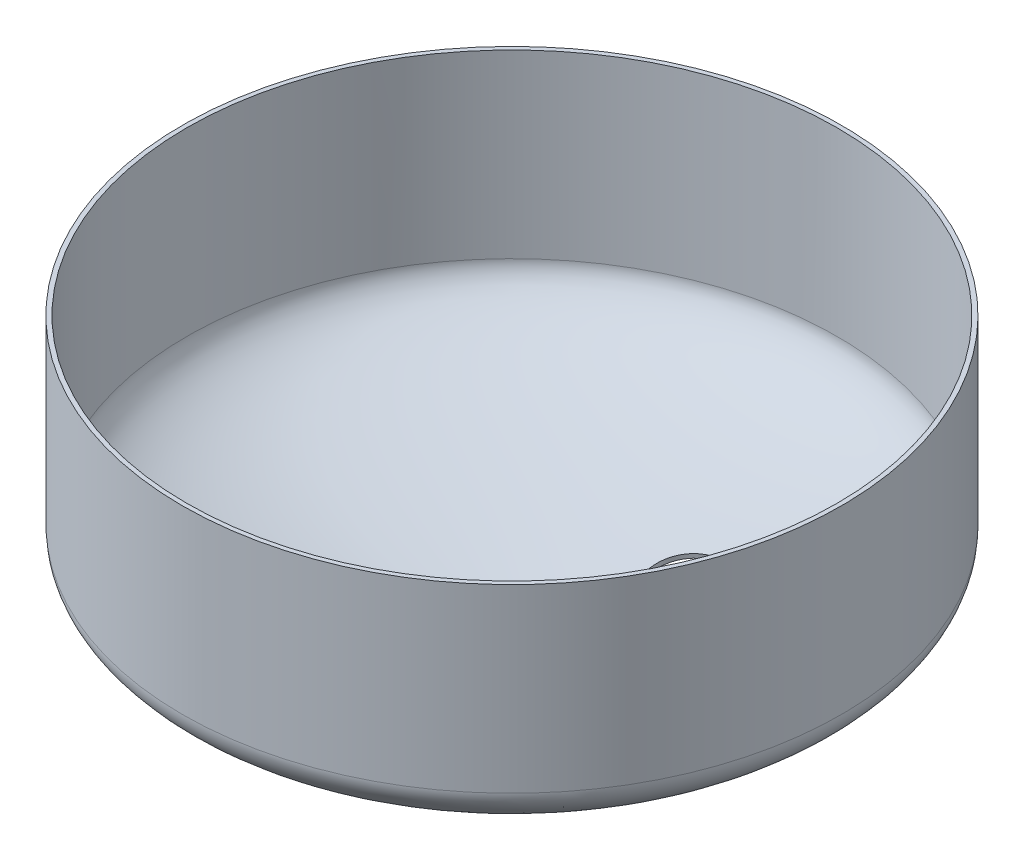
ISO-10303-21;
HEADER;
FILE_DESCRIPTION(('STEP AP214'),'2;1');
FILE_NAME('part.step','',(''),(''),'','','');
FILE_SCHEMA(('AUTOMOTIVE_DESIGN { 1 0 10303 214 1 1 1 1 }'));
ENDSEC;
DATA;
#1=APPLICATION_CONTEXT('core data for automotive mechanical design processes');
#2=APPLICATION_PROTOCOL_DEFINITION('international standard','automotive_design',2000,#1);
#3=PRODUCT_CONTEXT('',#1,'mechanical');
#4=PRODUCT('Part','Part','',(#3));
#5=PRODUCT_RELATED_PRODUCT_CATEGORY('part','',(#4));
#6=PRODUCT_DEFINITION_FORMATION('','',#4);
#7=PRODUCT_DEFINITION_CONTEXT('part definition',#1,'design');
#8=PRODUCT_DEFINITION('design','',#6,#7);
#9=PRODUCT_DEFINITION_SHAPE('','',#8);
#10=(LENGTH_UNIT() NAMED_UNIT(*) SI_UNIT(.MILLI.,.METRE.));
#11=(NAMED_UNIT(*) PLANE_ANGLE_UNIT() SI_UNIT($,.RADIAN.));
#12=(NAMED_UNIT(*) SI_UNIT($,.STERADIAN.) SOLID_ANGLE_UNIT());
#13=UNCERTAINTY_MEASURE_WITH_UNIT(LENGTH_MEASURE(1.E-05),#10,'distance_accuracy_value','');
#14=(GEOMETRIC_REPRESENTATION_CONTEXT(3) GLOBAL_UNCERTAINTY_ASSIGNED_CONTEXT((#13)) GLOBAL_UNIT_ASSIGNED_CONTEXT((#10,
#11,#12)) REPRESENTATION_CONTEXT('',''));
#15=CARTESIAN_POINT('',(0.,0.,0.));
#16=DIRECTION('',(0.,0.,1.));
#17=DIRECTION('',(1.,0.,0.));
#18=AXIS2_PLACEMENT_3D('',#15,#16,#17);
#19=CARTESIAN_POINT('',(0.,60.7998342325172,187.780368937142));
#20=DIRECTION('',(1.,0.,0.));
#21=DIRECTION('',(0.,0.,-1.));
#22=AXIS2_PLACEMENT_3D('',#19,#20,#21);
#23=ELLIPSE('',#22,377.780368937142,74.407850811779);
#24=TRIMMED_CURVE('',#23,(PARAMETER_VALUE(5.23259887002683)),
(PARAMETER_VALUE(7.33377174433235)),.T.,.PARAMETER.);
#25=CARTESIAN_POINT('',(0.,182.531914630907,0.));
#26=DIRECTION('',(0.,1.,0.));
#27=AXIS1_PLACEMENT('',#25,#26);
#28=SURFACE_OF_REVOLUTION('',#24,#27);
#29=CARTESIAN_POINT('',(0.,0.,0.));
#30=DIRECTION('',(0.,1.,0.));
#31=DIRECTION('',(0.,0.,1.));
#32=AXIS2_PLACEMENT_3D('',#29,#30,#31);
#33=CIRCLE('',#32,29.9999999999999);
#34=CARTESIAN_POINT('',(0.,0.,29.9999999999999));
#35=VERTEX_POINT('',#34);
#36=EDGE_CURVE('E10',#35,#35,#33,.T.);
#37=ORIENTED_EDGE('',*,*,#36,.T.);
#38=EDGE_LOOP('',(#37));
#39=FACE_BOUND('',#38,.T.);
#40=CARTESIAN_POINT('',(0.,60.7998342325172,0.));
#41=DIRECTION('',(0.,1.,0.));
#42=DIRECTION('',(0.,0.,1.));
#43=AXIS2_PLACEMENT_3D('',#40,#41,#42);
#44=CIRCLE('',#43,190.);
#45=CARTESIAN_POINT('',(0.,60.7998342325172,190.));
#46=VERTEX_POINT('',#45);
#47=EDGE_CURVE('E43',#46,#46,#44,.T.);
#48=ORIENTED_EDGE('',*,*,#47,.F.);
#49=EDGE_LOOP('',(#48));
#50=FACE_BOUND('',#49,.T.);
#51=CARTESIAN_POINT('',(29.9766896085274,11.3534303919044,-89.640225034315));
#52=CARTESIAN_POINT('',(30.5372190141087,11.3913939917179,-89.633517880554));
#53=CARTESIAN_POINT('',(31.0976608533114,11.4255208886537,-89.6034285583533));
#54=CARTESIAN_POINT('',(32.2147049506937,11.4859134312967,-89.4966945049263));
#55=CARTESIAN_POINT('',(32.7713061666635,11.5121770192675,-89.4200376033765));
#56=CARTESIAN_POINT('',(33.877129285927,11.5566895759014,-89.2205831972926));
#57=CARTESIAN_POINT('',(34.4263423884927,11.5749296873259,-89.0977349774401));
#58=CARTESIAN_POINT('',(35.5128279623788,11.6032401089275,-88.8067880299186));
#59=CARTESIAN_POINT('',(36.0501012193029,11.6133109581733,-88.6386922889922));
#60=CARTESIAN_POINT('',(37.1086787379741,11.6252194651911,-88.2585263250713));
#61=CARTESIAN_POINT('',(37.6299900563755,11.6270608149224,-88.0464758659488));
#62=CARTESIAN_POINT('',(38.6531971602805,11.6225090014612,-87.5798586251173));
#63=CARTESIAN_POINT('',(39.1550926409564,11.6161157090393,-87.325291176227));
#64=CARTESIAN_POINT('',(40.1357660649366,11.5951366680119,-86.7755235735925));
#65=CARTESIAN_POINT('',(40.6145498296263,11.5805529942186,-86.4803337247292));
#66=CARTESIAN_POINT('',(41.5457322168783,11.543285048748,-85.8513743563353));
#67=CARTESIAN_POINT('',(41.9981309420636,11.5206008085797,-85.5176049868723));
#68=CARTESIAN_POINT('',(42.8733717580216,11.4672694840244,-84.8138299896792));
#69=CARTESIAN_POINT('',(43.2962111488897,11.4366216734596,-84.4438210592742));
#70=CARTESIAN_POINT('',(44.1092853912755,11.3675531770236,-83.6702279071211));
#71=CARTESIAN_POINT('',(44.4995202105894,11.3291324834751,-83.2666436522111));
#72=CARTESIAN_POINT('',(45.2446291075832,11.2447528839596,-82.4287595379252));
#73=CARTESIAN_POINT('',(45.5995018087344,11.198793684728,-81.9944584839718));
#74=CARTESIAN_POINT('',(46.2713509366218,11.0996199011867,-81.0982501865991));
#75=CARTESIAN_POINT('',(46.5883273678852,11.0464053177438,-80.6363429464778));
#76=CARTESIAN_POINT('',(47.1821544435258,10.9330423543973,-79.6881854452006));
#77=CARTESIAN_POINT('',(47.4590025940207,10.8728935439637,-79.2019336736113));
#78=CARTESIAN_POINT('',(47.9705873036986,10.7460310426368,-78.2085807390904));
#79=CARTESIAN_POINT('',(48.2053238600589,10.6793173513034,-77.7014795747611));
#80=CARTESIAN_POINT('',(48.6310226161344,10.5397300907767,-76.6700449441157));
#81=CARTESIAN_POINT('',(48.821984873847,10.4668565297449,-76.1457115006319));
#82=CARTESIAN_POINT('',(49.1587845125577,10.3153905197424,-75.0835515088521));
#83=CARTESIAN_POINT('',(49.3046218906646,10.2367980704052,-74.5457249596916));
#84=CARTESIAN_POINT('',(49.55015460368,10.0743605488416,-73.4603588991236));
#85=CARTESIAN_POINT('',(49.6498451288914,9.9905149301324,-72.9128183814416));
#86=CARTESIAN_POINT('',(49.802359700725,9.81808457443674,-71.8119865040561));
#87=CARTESIAN_POINT('',(49.8551837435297,9.72949983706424,-71.2586951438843));
#88=CARTESIAN_POINT('',(49.9135964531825,9.54812645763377,-70.1503118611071));
#89=CARTESIAN_POINT('',(49.9191851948,9.45533782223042,-69.5952199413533));
#90=CARTESIAN_POINT('',(49.8830943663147,9.26611836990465,-68.4871976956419));
#91=CARTESIAN_POINT('',(49.8414147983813,9.16968755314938,-67.9342673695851));
#92=CARTESIAN_POINT('',(49.7110908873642,8.97377154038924,-66.8345228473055));
#93=CARTESIAN_POINT('',(49.622447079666,8.87428637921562,-66.287708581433));
#94=CARTESIAN_POINT('',(49.3988315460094,8.67287041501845,-65.2040948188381));
#95=CARTESIAN_POINT('',(49.2638598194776,8.57093961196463,-64.6672953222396));
#96=CARTESIAN_POINT('',(48.9485542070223,8.36526377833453,-63.6075448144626));
#97=CARTESIAN_POINT('',(48.7682203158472,8.26151874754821,-63.0845938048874));
#98=CARTESIAN_POINT('',(48.363478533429,8.05286627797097,-62.0562749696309));
#99=CARTESIAN_POINT('',(48.13907064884,7.94795883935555,-61.5509071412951));
#100=CARTESIAN_POINT('',(47.6478242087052,7.73767064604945,-60.5614473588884));
#101=CARTESIAN_POINT('',(47.3809929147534,7.63228997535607,-60.0773517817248));
#102=CARTESIAN_POINT('',(46.8067740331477,7.42172660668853,-59.1337978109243));
#103=CARTESIAN_POINT('',(46.4993864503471,7.31654390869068,-58.6743394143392));
#104=CARTESIAN_POINT('',(45.846244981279,7.10708321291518,-57.7833351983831));
#105=CARTESIAN_POINT('',(45.5004911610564,7.00280521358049,-57.3517893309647));
#106=CARTESIAN_POINT('',(44.7730777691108,6.79587670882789,-56.5196810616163));
#107=CARTESIAN_POINT('',(44.3914181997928,6.69322620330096,-56.1191186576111));
#108=CARTESIAN_POINT('',(43.5949639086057,6.49030509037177,-55.3518774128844));
#109=CARTESIAN_POINT('',(43.1801738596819,6.39003414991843,-54.9851938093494));
#110=CARTESIAN_POINT('',(42.3203585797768,6.19260830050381,-54.2882448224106));
#111=CARTESIAN_POINT('',(41.8753333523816,6.09545339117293,-53.9579794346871));
#112=CARTESIAN_POINT('',(40.9582055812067,5.90502122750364,-53.336199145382));
#113=CARTESIAN_POINT('',(40.4861030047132,5.81174397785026,-53.0446842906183));
#114=CARTESIAN_POINT('',(39.51816813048,5.62983583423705,-52.5024559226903));
#115=CARTESIAN_POINT('',(39.0223358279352,5.54120494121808,-52.251742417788));
#116=CARTESIAN_POINT('',(38.0103715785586,5.36934570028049,-51.7928337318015));
#117=CARTESIAN_POINT('',(37.4942363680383,5.28611822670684,-51.5846454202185));
#118=CARTESIAN_POINT('',(36.445394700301,5.12584599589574,-51.2122845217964));
#119=CARTESIAN_POINT('',(35.9126882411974,5.04880123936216,-51.0481119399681));
#120=CARTESIAN_POINT('',(34.8344702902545,4.90164324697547,-50.7649115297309));
#121=CARTESIAN_POINT('',(34.2889587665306,4.8315300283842,-50.6458838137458));
#122=CARTESIAN_POINT('',(33.1889881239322,4.69895652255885,-50.453779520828));
#123=CARTESIAN_POINT('',(32.6345290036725,4.6364962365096,-50.3807029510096));
#124=CARTESIAN_POINT('',(31.5204373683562,4.51989207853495,-50.2809665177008));
#125=CARTESIAN_POINT('',(30.9608035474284,4.46575037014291,-50.2543187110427));
#126=CARTESIAN_POINT('',(29.8404633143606,4.36642237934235,-50.2476267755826));
#127=CARTESIAN_POINT('',(29.2797569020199,4.32123609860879,-50.2675826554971));
#128=CARTESIAN_POINT('',(28.1612424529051,4.24036057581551,-50.35391976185));
#129=CARTESIAN_POINT('',(27.6034344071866,4.2046713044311,-50.4203008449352));
#130=CARTESIAN_POINT('',(26.4946680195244,4.14323444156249,-50.598985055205));
#131=CARTESIAN_POINT('',(25.9437096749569,4.1174868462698,-50.7112881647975));
#132=CARTESIAN_POINT('',(24.8527113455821,4.07627030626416,-50.9809541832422));
#133=CARTESIAN_POINT('',(24.3126682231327,4.06079836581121,-51.1383039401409));
#134=CARTESIAN_POINT('',(23.2471701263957,4.04032416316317,-51.4969420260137));
#135=CARTESIAN_POINT('',(22.7217151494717,4.03532189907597,-51.6982303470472));
#136=CARTESIAN_POINT('',(21.689131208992,4.0358533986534,-52.143307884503));
#137=CARTESIAN_POINT('',(21.1820022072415,4.04138714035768,-52.3870970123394));
#138=CARTESIAN_POINT('',(20.1896798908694,4.06291722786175,-52.9154472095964));
#139=CARTESIAN_POINT('',(19.7044865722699,4.07891357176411,-53.2000082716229));
#140=CARTESIAN_POINT('',(18.7596869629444,4.12115045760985,-53.807769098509));
#141=CARTESIAN_POINT('',(18.3000702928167,4.14738680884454,-54.1309530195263));
#142=CARTESIAN_POINT('',(17.4094855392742,4.20976761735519,-54.8137804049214));
#143=CARTESIAN_POINT('',(16.978517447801,4.24591207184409,-55.1734238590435));
#144=CARTESIAN_POINT('',(16.1483017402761,4.3276601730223,-55.926649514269));
#145=CARTESIAN_POINT('',(15.749054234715,4.37326385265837,-56.3202318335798));
#146=CARTESIAN_POINT('',(14.9851301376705,4.47338577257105,-57.1385777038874));
#147=CARTESIAN_POINT('',(14.6204535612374,4.52790401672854,-57.5633412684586));
#148=CARTESIAN_POINT('',(13.9281434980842,4.64525591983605,-58.4412429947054));
#149=CARTESIAN_POINT('',(13.6005241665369,4.70809273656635,-58.8943918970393));
#150=CARTESIAN_POINT('',(12.984831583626,4.84138486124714,-59.825742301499));
#151=CARTESIAN_POINT('',(12.6967583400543,4.9118401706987,-60.3039438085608));
#152=CARTESIAN_POINT('',(12.1622198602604,5.05964654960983,-61.2820436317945));
#153=CARTESIAN_POINT('',(11.9157546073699,5.13699761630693,-61.7819419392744));
#154=CARTESIAN_POINT('',(11.4661977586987,5.29784568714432,-62.7999220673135));
#155=CARTESIAN_POINT('',(11.2631061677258,5.38134269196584,-63.3180038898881));
#156=CARTESIAN_POINT('',(10.9016956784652,5.55374529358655,-64.3688706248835));
#157=CARTESIAN_POINT('',(10.7433910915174,5.64265260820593,-64.901660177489));
#158=CARTESIAN_POINT('',(10.4727787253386,5.8250806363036,-65.9780218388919));
#159=CARTESIAN_POINT('',(10.3604709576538,5.91860135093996,-66.5215939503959));
#160=CARTESIAN_POINT('',(10.1826608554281,6.10948689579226,-67.6156748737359));
#161=CARTESIAN_POINT('',(10.117158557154,6.20685172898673,-68.1661836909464));
#162=CARTESIAN_POINT('',(10.0334328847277,6.40466314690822,-69.2702345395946));
#163=CARTESIAN_POINT('',(10.0152094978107,6.5051097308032,-69.8237765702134));
#164=CARTESIAN_POINT('',(10.0261745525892,6.70830840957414,-70.9298274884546));
#165=CARTESIAN_POINT('',(10.0553514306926,6.81105993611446,-71.4823365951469));
#166=CARTESIAN_POINT('',(10.1608896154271,7.01815468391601,-72.5825289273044));
#167=CARTESIAN_POINT('',(10.2372509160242,7.12249790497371,-73.1302121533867));
#168=CARTESIAN_POINT('',(10.4366143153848,7.33205390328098,-74.216854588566));
#169=CARTESIAN_POINT('',(10.5596164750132,7.43726668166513,-74.7558137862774));
#170=CARTESIAN_POINT('',(10.8513838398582,7.64785586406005,-75.821166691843));
#171=CARTESIAN_POINT('',(11.0201490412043,7.75323226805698,-76.3475604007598));
#172=CARTESIAN_POINT('',(11.4022069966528,7.96344364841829,-77.3839455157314));
#173=CARTESIAN_POINT('',(11.6154926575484,8.06827870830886,-77.8939395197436));
#174=CARTESIAN_POINT('',(12.0850853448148,8.27675474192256,-78.8939746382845));
#175=CARTESIAN_POINT('',(12.3413923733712,8.38039571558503,-79.3840157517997));
#176=CARTESIAN_POINT('',(12.8951881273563,8.58582938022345,-80.3406289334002));
#177=CARTESIAN_POINT('',(13.1926752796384,8.68762214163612,-80.8072018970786));
#178=CARTESIAN_POINT('',(13.8267165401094,8.88873358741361,-81.7135671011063));
#179=CARTESIAN_POINT('',(14.1632706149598,8.98805227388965,-82.153359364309));
#180=CARTESIAN_POINT('',(14.873054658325,9.18360980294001,-83.0030321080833));
#181=CARTESIAN_POINT('',(15.2462854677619,9.27984857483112,-83.4129119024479));
#182=CARTESIAN_POINT('',(16.0267582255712,9.46865927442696,-84.1998213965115));
#183=CARTESIAN_POINT('',(16.4340003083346,9.56123118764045,-84.5768509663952));
#184=CARTESIAN_POINT('',(17.2797012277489,9.74217071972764,-85.295454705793));
#185=CARTESIAN_POINT('',(17.7181679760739,9.83053726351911,-85.6370198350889));
#186=CARTESIAN_POINT('',(18.6230953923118,10.0025058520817,-86.2821362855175));
#187=CARTESIAN_POINT('',(19.0895556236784,10.0861079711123,-86.5856881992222));
#188=CARTESIAN_POINT('',(20.0474556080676,10.2480954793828,-87.1527894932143));
#189=CARTESIAN_POINT('',(20.5389108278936,10.3264775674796,-87.4163136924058));
#190=CARTESIAN_POINT('',(21.5430583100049,10.4774982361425,-87.9012571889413));
#191=CARTESIAN_POINT('',(22.0557519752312,10.5501364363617,-88.1226736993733));
#192=CARTESIAN_POINT('',(23.0981291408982,10.6891476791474,-88.5215718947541));
#193=CARTESIAN_POINT('',(23.627793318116,10.7555275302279,-88.6991016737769));
#194=CARTESIAN_POINT('',(24.7006950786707,10.8816892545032,-89.0092243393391));
#195=CARTESIAN_POINT('',(25.2439290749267,10.9414728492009,-89.1418289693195));
#196=CARTESIAN_POINT('',(26.4791717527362,11.0683675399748,-89.3889930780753));
#197=CARTESIAN_POINT('',(27.1740363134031,11.1335035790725,-89.4904909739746));
#198=CARTESIAN_POINT('',(28.5715429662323,11.2522453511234,-89.620309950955));
#199=CARTESIAN_POINT('',(29.2741850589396,11.3058510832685,-89.6486310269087));
#200=CARTESIAN_POINT('',(29.9766896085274,11.3534303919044,-89.640225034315));
#201=B_SPLINE_CURVE_WITH_KNOTS('',3,(#51,#52,#53,#54,#55,#56,#57,#58,#59,#60,#61,#62,#63,#64,
#65,#66,#67,#68,#69,#70,#71,#72,#73,#74,#75,#76,#77,#78,#79,#80,#81,#82,#83,#84,#85,#86,#87,#88,
#89,#90,#91,#92,#93,#94,#95,#96,#97,#98,#99,#100,#101,#102,#103,#104,#105,#106,#107,#108,#109,
#110,#111,#112,#113,#114,#115,#116,#117,#118,#119,#120,#121,#122,#123,#124,#125,#126,#127,#128,
#129,#130,#131,#132,#133,#134,#135,#136,#137,#138,#139,#140,#141,#142,#143,#144,#145,#146,#147,
#148,#149,#150,#151,#152,#153,#154,#155,#156,#157,#158,#159,#160,#161,#162,#163,#164,#165,#166,
#167,#168,#169,#170,#171,#172,#173,#174,#175,#176,#177,#178,#179,#180,#181,#182,#183,#184,#185,
#186,#187,#188,#189,#190,#191,#192,#193,#194,#195,#196,#197,#198,#199,#200),.UNSPECIFIED.,.T.,
.F.,(4,2,2,2,2,2,2,2,2,2,2,2,2,2,2,2,2,2,2,2,2,2,2,2,2,2,2,2,2,2,2,2,2,2,2,2,2,2,2,2,2,2,2,2,2,
2,2,2,2,2,2,2,2,2,2,2,2,2,2,2,2,2,2,2,2,2,2,2,2,2,2,2,2,2,4),(0.,1.68494583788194,
3.37033222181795,5.05757448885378,6.74470541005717,8.43107936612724,10.1174797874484,
11.8034531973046,13.4894200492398,15.1755406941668,16.8616630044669,18.5478509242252,
20.2340386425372,21.9203311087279,23.6066236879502,25.2929140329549,26.9792044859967,
28.6656706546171,30.3521369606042,32.0386005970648,33.7250641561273,35.4115084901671,
37.097952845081,38.7843973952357,40.4708416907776,42.1569976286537,43.8431533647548,
45.5293061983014,47.2154589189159,48.9013742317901,50.5872893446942,52.2732064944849,
53.9591239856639,55.6453136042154,57.3315034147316,59.01769742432,60.7038916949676,
62.3905237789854,64.0771561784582,65.7637833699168,67.4504099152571,69.1365445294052,
70.8226788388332,72.5088096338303,74.1949401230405,75.8803812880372,77.565821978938,
79.251268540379,80.9367158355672,82.6228047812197,84.3088940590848,85.9949826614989,
87.6810714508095,89.3676984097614,91.0543257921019,92.7409544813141,94.4275827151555,
96.1137995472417,97.8000161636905,99.4862349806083,101.172453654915,102.858403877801,
104.544354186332,106.230240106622,107.916124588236,109.602047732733,111.287977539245,
112.974336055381,114.660668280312,116.348057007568,118.035557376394,119.721200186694,
121.406402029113,123.518123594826,125.629845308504),.UNSPECIFIED.);
#202=CARTESIAN_POINT('',(29.9766896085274,11.3534303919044,-89.640225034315));
#203=VERTEX_POINT('',#202);
#204=EDGE_CURVE('E61',#203,#203,#201,.T.);
#205=ORIENTED_EDGE('',*,*,#204,.F.);
#206=EDGE_LOOP('',(#205));
#207=FACE_BOUND('',#206,.T.);
#208=ADVANCED_FACE('F31',(#39,#50,#207),#28,.T.);
#209=CARTESIAN_POINT('',(0.,60.7998342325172,187.780368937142));
#210=DIRECTION('',(1.,0.,0.));
#211=DIRECTION('',(0.,0.,-1.));
#212=AXIS2_PLACEMENT_3D('',#209,#210,#211);
#213=ELLIPSE('',#212,377.780368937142,74.407850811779);
#214=TRIMMED_CURVE('',#213,(PARAMETER_VALUE(5.23259887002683)),
(PARAMETER_VALUE(7.33377174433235)),.T.,.PARAMETER.);
#215=CARTESIAN_POINT('',(0.,182.531914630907,0.));
#216=DIRECTION('',(0.,1.,0.));
#217=AXIS1_PLACEMENT('',#215,#216);
#218=SURFACE_OF_REVOLUTION('',#214,#217);
#219=OFFSET_SURFACE('',#218,-2.5,.F.);
#220=CARTESIAN_POINT('',(0.,2.5,0.));
#221=DIRECTION('',(0.,1.,0.));
#222=DIRECTION('',(0.,0.,1.));
#223=AXIS2_PLACEMENT_3D('',#220,#221,#222);
#224=CIRCLE('',#223,29.8270353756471);
#225=CARTESIAN_POINT('',(0.,2.5,29.8270353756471));
#226=VERTEX_POINT('',#225);
#227=EDGE_CURVE('E70',#226,#226,#224,.T.);
#228=ORIENTED_EDGE('',*,*,#227,.F.);
#229=EDGE_LOOP('',(#228));
#230=FACE_BOUND('',#229,.T.);
#231=CARTESIAN_POINT('',(0.,60.7998342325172,0.));
#232=DIRECTION('',(0.,1.,0.));
#233=DIRECTION('',(0.,0.,1.));
#234=AXIS2_PLACEMENT_3D('',#231,#232,#233);
#235=CIRCLE('',#234,187.5);
#236=CARTESIAN_POINT('',(0.,60.7998342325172,187.5));
#237=VERTEX_POINT('',#236);
#238=EDGE_CURVE('E58',#237,#237,#235,.T.);
#239=ORIENTED_EDGE('',*,*,#238,.T.);
#240=EDGE_LOOP('',(#239));
#241=FACE_BOUND('',#240,.T.);
#242=CARTESIAN_POINT('',(29.7905891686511,13.8097378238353,-89.2059906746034));
#243=CARTESIAN_POINT('',(30.3511195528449,13.8476750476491,-89.1992881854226));
#244=CARTESIAN_POINT('',(30.9115621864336,13.8817780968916,-89.1692031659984));
#245=CARTESIAN_POINT('',(32.0286075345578,13.9421283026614,-89.0624769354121));
#246=CARTESIAN_POINT('',(32.5852092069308,13.9683734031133,-88.9858235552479));
#247=CARTESIAN_POINT('',(33.6910328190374,14.0128545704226,-88.7863753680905));
#248=CARTESIAN_POINT('',(34.2402459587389,14.0310817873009,-88.6635298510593));
#249=CARTESIAN_POINT('',(35.3267312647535,14.0593722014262,-88.3725874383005));
#250=CARTESIAN_POINT('',(35.8640042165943,14.0694359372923,-88.2044935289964));
#251=CARTESIAN_POINT('',(36.9225808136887,14.0813360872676,-87.8243303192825));
#252=CARTESIAN_POINT('',(37.4438915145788,14.0831761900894,-87.6122807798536));
#253=CARTESIAN_POINT('',(38.4670970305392,14.0786277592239,-87.1456644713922));
#254=CARTESIAN_POINT('',(38.9689915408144,14.0722390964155,-86.8910970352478));
#255=CARTESIAN_POINT('',(39.9496626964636,14.0512751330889,-86.3413285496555));
#256=CARTESIAN_POINT('',(40.4284451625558,14.0367019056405,-86.046137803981));
#257=CARTESIAN_POINT('',(41.3596246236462,13.9994605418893,-85.4171757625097));
#258=CARTESIAN_POINT('',(41.8120217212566,13.9767924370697,-85.0834046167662));
#259=CARTESIAN_POINT('',(42.6872588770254,13.9234988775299,-84.3796253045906));
#260=CARTESIAN_POINT('',(43.1100962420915,13.8928726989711,-84.009613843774));
#261=CARTESIAN_POINT('',(43.9231661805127,13.8238526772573,-83.2360148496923));
#262=CARTESIAN_POINT('',(44.3133987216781,13.7854588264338,-82.8324272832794));
#263=CARTESIAN_POINT('',(45.0585028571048,13.7011377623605,-81.9945358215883));
#264=CARTESIAN_POINT('',(45.4133730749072,13.6552102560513,-81.5602307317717));
#265=CARTESIAN_POINT('',(46.0852170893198,13.556104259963,-80.6640137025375));
#266=CARTESIAN_POINT('',(46.4021908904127,13.5029257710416,-80.2021017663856));
#267=CARTESIAN_POINT('',(46.9960129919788,13.3896387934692,-79.2539336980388));
#268=CARTESIAN_POINT('',(47.2728587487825,13.3295298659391,-78.7676760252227));
#269=CARTESIAN_POINT('',(47.7844385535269,13.2027503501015,-77.7743107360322));
#270=CARTESIAN_POINT('',(48.0191725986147,13.1360797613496,-77.2672031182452));
#271=CARTESIAN_POINT('',(48.4448662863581,12.9965812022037,-76.2357551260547));
#272=CARTESIAN_POINT('',(48.6358259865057,12.923753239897,-75.7114147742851));
#273=CARTESIAN_POINT('',(48.9726205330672,12.7723801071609,-74.6492406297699));
#274=CARTESIAN_POINT('',(49.1184553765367,12.6938349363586,-74.1114068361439));
#275=CARTESIAN_POINT('',(49.3639833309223,12.5314926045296,-73.0260251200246));
#276=CARTESIAN_POINT('',(49.463671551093,12.4476948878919,-72.4784761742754));
#277=CARTESIAN_POINT('',(49.6161815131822,12.2753600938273,-71.3776273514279));
#278=CARTESIAN_POINT('',(49.6690032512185,12.1868230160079,-70.8243274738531));
#279=CARTESIAN_POINT('',(49.7274114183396,12.00554363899,-69.7159272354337));
#280=CARTESIAN_POINT('',(49.7329979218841,11.9128013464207,-69.1608268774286));
#281=CARTESIAN_POINT('',(49.6969027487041,11.7236721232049,-68.0527880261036));
#282=CARTESIAN_POINT('',(49.6552210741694,11.6272851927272,-67.4998495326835));
#283=CARTESIAN_POINT('',(49.52489313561,11.4314532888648,-66.4000890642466));
#284=CARTESIAN_POINT('',(49.4362473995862,11.332008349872,-65.8532670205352));
#285=CARTESIAN_POINT('',(49.2126282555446,11.1306679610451,-64.7696384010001));
#286=CARTESIAN_POINT('',(49.0776548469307,11.0287725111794,-64.2328318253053));
#287=CARTESIAN_POINT('',(48.7623461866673,10.8231612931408,-63.1730681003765));
#288=CARTESIAN_POINT('',(48.5820109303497,10.7194455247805,-62.6501109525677));
#289=CARTESIAN_POINT('',(48.1772668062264,10.5108442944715,-61.6217810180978));
#290=CARTESIAN_POINT('',(47.9528579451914,10.4059588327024,-61.1164082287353));
#291=CARTESIAN_POINT('',(47.4616107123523,10.1957064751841,-60.1269413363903));
#292=CARTESIAN_POINT('',(47.1947797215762,10.0903396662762,-59.6428435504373));
#293=CARTESIAN_POINT('',(46.6205622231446,9.87979459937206,-58.6992866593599));
#294=CARTESIAN_POINT('',(46.3131757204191,9.77461634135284,-58.2398275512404));
#295=CARTESIAN_POINT('',(45.6600372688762,9.56515425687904,-57.3488235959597));
#296=CARTESIAN_POINT('',(45.3142853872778,9.46087042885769,-56.9172786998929));
#297=CARTESIAN_POINT('',(44.5868767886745,9.25391937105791,-56.0851741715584));
#298=CARTESIAN_POINT('',(44.2052200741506,9.15125214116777,-55.6846145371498));
#299=CARTESIAN_POINT('',(43.408773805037,8.948286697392,-54.9173819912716));
#300=CARTESIAN_POINT('',(42.9939890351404,8.84798814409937,-54.55070420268));
#301=CARTESIAN_POINT('',(42.1341855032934,8.65049585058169,-53.8537684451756));
#302=CARTESIAN_POINT('',(41.6891667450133,8.55330210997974,-53.5235104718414));
#303=CARTESIAN_POINT('',(40.7720530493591,8.36278151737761,-52.9017464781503));
#304=CARTESIAN_POINT('',(40.299958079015,8.26945467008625,-52.6102405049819));
#305=CARTESIAN_POINT('',(39.3320394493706,8.08743751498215,-52.0680311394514));
#306=CARTESIAN_POINT('',(38.8362157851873,7.9987472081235,-51.8173277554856));
#307=CARTESIAN_POINT('',(37.82426863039,7.82676063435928,-51.3584397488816));
#308=CARTESIAN_POINT('',(37.308141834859,7.74346525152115,-51.1502620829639));
#309=CARTESIAN_POINT('',(36.259317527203,7.58305098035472,-50.7779231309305));
#310=CARTESIAN_POINT('',(35.7266200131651,7.50593209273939,-50.6137618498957));
#311=CARTESIAN_POINT('',(34.6484201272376,7.35862225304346,-50.3305841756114));
#312=CARTESIAN_POINT('',(34.1029177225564,7.2884313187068,-50.2115678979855));
#313=CARTESIAN_POINT('',(33.002965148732,7.1557019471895,-50.0194860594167));
#314=CARTESIAN_POINT('',(32.4485149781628,7.09316351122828,-49.946420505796));
#315=CARTESIAN_POINT('',(31.3344372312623,6.97640576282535,-49.8467047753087));
#316=CARTESIAN_POINT('',(30.7748083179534,6.92218866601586,-49.8200669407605));
#317=CARTESIAN_POINT('',(29.6544769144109,6.82271681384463,-49.8133938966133));
#318=CARTESIAN_POINT('',(29.0937744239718,6.77746206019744,-49.8333586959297));
#319=CARTESIAN_POINT('',(27.9752665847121,6.69646016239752,-49.9197120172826));
#320=CARTESIAN_POINT('',(27.4174612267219,6.66071298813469,-49.9861003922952));
#321=CARTESIAN_POINT('',(26.3086987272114,6.59917417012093,-50.1647970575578));
#322=CARTESIAN_POINT('',(25.7577415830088,6.57338252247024,-50.2771053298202));
#323=CARTESIAN_POINT('',(24.6667471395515,6.53209446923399,-50.5467783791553));
#324=CARTESIAN_POINT('',(24.1267066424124,6.51659500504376,-50.7041297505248));
#325=CARTESIAN_POINT('',(23.0612120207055,6.49608376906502,-51.0627677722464));
#326=CARTESIAN_POINT('',(22.5357578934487,6.49107199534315,-51.2640544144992));
#327=CARTESIAN_POINT('',(21.5031739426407,6.49160305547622,-51.7091251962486));
#328=CARTESIAN_POINT('',(20.9960440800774,6.49714586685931,-51.9529092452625));
#329=CARTESIAN_POINT('',(20.003718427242,6.518712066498,-52.4812459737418));
#330=CARTESIAN_POINT('',(19.5185226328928,6.5347354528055,-52.7657986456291));
#331=CARTESIAN_POINT('',(18.5737214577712,6.57704245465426,-53.3735365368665));
#332=CARTESIAN_POINT('',(18.1141054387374,6.60332176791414,-53.6967055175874));
#333=CARTESIAN_POINT('',(17.2235201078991,6.66580192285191,-54.3794996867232));
#334=CARTESIAN_POINT('',(16.7925507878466,6.70200276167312,-54.7391248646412));
#335=CARTESIAN_POINT('',(15.9623308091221,6.78387379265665,-55.4923113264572));
#336=CARTESIAN_POINT('',(15.5630802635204,6.8295440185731,-55.8858727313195));
#337=CARTESIAN_POINT('',(14.7991484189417,6.92980557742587,-56.7041748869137));
#338=CARTESIAN_POINT('',(14.4344671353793,6.98439691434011,-57.1289156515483));
#339=CARTESIAN_POINT('',(13.7421428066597,7.10189847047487,-58.0067749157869));
#340=CARTESIAN_POINT('',(13.4145142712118,7.16481192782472,-58.4599044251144));
#341=CARTESIAN_POINT('',(12.7988026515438,7.29825687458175,-59.391216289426));
#342=CARTESIAN_POINT('',(12.5107195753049,7.36878836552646,-59.8693986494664));
#343=CARTESIAN_POINT('',(11.9761610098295,7.51674353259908,-60.8474611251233));
#344=CARTESIAN_POINT('',(11.7296855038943,7.59416720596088,-61.3473412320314));
#345=CARTESIAN_POINT('',(11.2801079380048,7.7551543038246,-62.3652865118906));
#346=CARTESIAN_POINT('',(11.0770058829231,7.83871772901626,-62.8833516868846));
#347=CARTESIAN_POINT('',(10.715573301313,8.01124550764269,-63.9341905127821));
#348=CARTESIAN_POINT('',(10.5572573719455,8.10021161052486,-64.4669688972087));
#349=CARTESIAN_POINT('',(10.2866230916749,8.28274755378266,-65.5433107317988));
#350=CARTESIAN_POINT('',(10.1743047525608,8.37631739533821,-66.0868741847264));
#351=CARTESIAN_POINT('',(9.99647445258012,8.5672905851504,-67.1809404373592));
#352=CARTESIAN_POINT('',(9.93096252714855,8.66469393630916,-67.7314432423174));
#353=CARTESIAN_POINT('',(9.8472186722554,8.86257133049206,-68.8354847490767));
#354=CARTESIAN_POINT('',(9.82898672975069,8.96304537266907,-69.3890234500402));
#355=CARTESIAN_POINT('',(9.8399357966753,9.16628728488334,-70.4950670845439));
#356=CARTESIAN_POINT('',(9.86910496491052,9.26905457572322,-71.0475722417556));
#357=CARTESIAN_POINT('',(9.97462836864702,9.47617009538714,-72.1477592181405));
#358=CARTESIAN_POINT('',(10.0509825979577,9.58051832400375,-72.6954410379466));
#359=CARTESIAN_POINT('',(10.2503324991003,9.79007421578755,-73.782083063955));
#360=CARTESIAN_POINT('',(10.3733282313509,9.89528188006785,-74.3210432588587));
#361=CARTESIAN_POINT('',(10.6650833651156,10.1058515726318,-75.3864003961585));
#362=CARTESIAN_POINT('',(10.8338427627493,10.2112136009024,-75.9127973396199));
#363=CARTESIAN_POINT('',(11.2158892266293,10.4213877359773,-76.9491896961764));
#364=CARTESIAN_POINT('',(11.4291690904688,10.5261999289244,-77.45918774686));
#365=CARTESIAN_POINT('',(11.8987505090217,10.734623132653,-78.4592329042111));
#366=CARTESIAN_POINT('',(12.1550520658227,10.8382341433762,-78.9492800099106));
#367=CARTESIAN_POINT('',(12.7088371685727,11.0436019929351,-79.9059069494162));
#368=CARTESIAN_POINT('',(13.0063191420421,11.145358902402,-80.3724876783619));
#369=CARTESIAN_POINT('',(13.6403503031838,11.3463939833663,-81.2788699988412));
#370=CARTESIAN_POINT('',(13.9768994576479,11.4456721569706,-81.7186716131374));
#371=CARTESIAN_POINT('',(14.6866750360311,11.6411455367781,-82.5683658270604));
#372=CARTESIAN_POINT('',(15.0599024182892,11.7373406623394,-82.9782576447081));
#373=CARTESIAN_POINT('',(15.8403687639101,11.9260618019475,-83.7651921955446));
#374=CARTESIAN_POINT('',(16.2476078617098,12.0185878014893,-84.1422347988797));
#375=CARTESIAN_POINT('',(17.0933032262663,12.1994343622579,-84.8608654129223));
#376=CARTESIAN_POINT('',(17.5317674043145,12.2877538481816,-85.2024443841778));
#377=CARTESIAN_POINT('',(18.43669009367,12.4596282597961,-85.8475891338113));
#378=CARTESIAN_POINT('',(18.9031481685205,12.5431832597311,-86.1511555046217));
#379=CARTESIAN_POINT('',(19.8610456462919,12.7050776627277,-86.7182869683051));
#380=CARTESIAN_POINT('',(20.3525005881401,12.7834137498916,-86.9818267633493));
#381=CARTESIAN_POINT('',(21.3566480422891,12.934344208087,-87.4668014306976));
#382=CARTESIAN_POINT('',(21.8693419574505,13.0069381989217,-87.6882335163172));
#383=CARTESIAN_POINT('',(22.9117201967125,13.1458636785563,-88.0871626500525));
#384=CARTESIAN_POINT('',(23.4413851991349,13.2122019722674,-88.2647077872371));
#385=CARTESIAN_POINT('',(24.5142890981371,13.3382838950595,-88.5748607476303));
#386=CARTESIAN_POINT('',(25.0575244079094,13.3980292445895,-88.7074803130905));
#387=CARTESIAN_POINT('',(26.2928173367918,13.5248469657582,-88.9546867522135));
#388=CARTESIAN_POINT('',(26.9877320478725,13.5899446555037,-89.0562069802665));
#389=CARTESIAN_POINT('',(28.3853401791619,13.7086152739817,-89.1860593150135));
#390=CARTESIAN_POINT('',(29.0880335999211,13.7621882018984,-89.2143914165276));
#391=CARTESIAN_POINT('',(29.7905891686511,13.8097378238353,-89.2059906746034));
#392=B_SPLINE_CURVE_WITH_KNOTS('',3,(#242,#243,#244,#245,#246,#247,#248,#249,#250,#251,#252,
#253,#254,#255,#256,#257,#258,#259,#260,#261,#262,#263,#264,#265,#266,#267,#268,#269,#270,#271,
#272,#273,#274,#275,#276,#277,#278,#279,#280,#281,#282,#283,#284,#285,#286,#287,#288,#289,#290,
#291,#292,#293,#294,#295,#296,#297,#298,#299,#300,#301,#302,#303,#304,#305,#306,#307,#308,#309,
#310,#311,#312,#313,#314,#315,#316,#317,#318,#319,#320,#321,#322,#323,#324,#325,#326,#327,#328,
#329,#330,#331,#332,#333,#334,#335,#336,#337,#338,#339,#340,#341,#342,#343,#344,#345,#346,#347,
#348,#349,#350,#351,#352,#353,#354,#355,#356,#357,#358,#359,#360,#361,#362,#363,#364,#365,#366,
#367,#368,#369,#370,#371,#372,#373,#374,#375,#376,#377,#378,#379,#380,#381,#382,#383,#384,#385,
#386,#387,#388,#389,#390,#391),.UNSPECIFIED.,.T.,.F.,(4,2,2,2,2,2,2,2,2,2,2,2,2,2,2,2,2,2,2,2,2,
2,2,2,2,2,2,2,2,2,2,2,2,2,2,2,2,2,2,2,2,2,2,2,2,2,2,2,2,2,2,2,2,2,2,2,2,2,2,2,2,2,2,2,2,2,2,2,2,
2,2,2,2,2,4),(0.,1.68494321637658,3.37032692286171,5.05756628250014,6.74469431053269,
8.43106550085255,10.1174631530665,11.8034338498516,13.4893979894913,15.1755155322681,
16.8616347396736,18.547819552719,20.2340041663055,21.9202956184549,23.6065871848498,
25.2928765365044,26.9791659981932,28.6656341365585,30.3521024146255,32.0385680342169,
33.7250335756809,35.4114801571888,37.0979267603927,38.7843735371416,40.470820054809,
42.1569734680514,43.8431266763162,45.5292769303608,47.2154270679,48.9013341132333,
50.5872409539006,52.2731498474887,53.9590590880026,55.6452439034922,57.3314289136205,
59.0176182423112,60.7038078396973,62.3904456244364,64.0770837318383,65.7637164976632,
67.4503486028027,69.1364792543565,70.8226095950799,72.508736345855,74.1948627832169,
75.8802826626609,77.5657020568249,79.2511274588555,80.9365536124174,82.622637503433,
84.3087217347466,85.9948052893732,87.6808890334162,89.3675216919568,91.0541547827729,
92.7407891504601,94.4274230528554,96.1136356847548,97.7998480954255,99.4860626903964,
101.172277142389,102.858219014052,104.544160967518,106.230038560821,107.915914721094,
109.601834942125,111.287761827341,112.974117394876,114.660446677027,116.347837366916,
118.035339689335,119.7209846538,121.406188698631,123.518056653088,125.629924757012),.UNSPECIFIED.);
#393=CARTESIAN_POINT('',(29.7905891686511,13.8097378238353,-89.2059906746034));
#394=VERTEX_POINT('',#393);
#395=EDGE_CURVE('E35',#394,#394,#392,.T.);
#396=ORIENTED_EDGE('',*,*,#395,.T.);
#397=EDGE_LOOP('',(#396));
#398=FACE_BOUND('',#397,.T.);
#399=ADVANCED_FACE('F81',(#230,#241,#398),#219,.F.);
#400=CARTESIAN_POINT('',(0.,165.,-190.));
#401=DIRECTION('',(0.,-1.,0.));
#402=DIRECTION('',(0.,0.,-1.));
#403=AXIS2_PLACEMENT_3D('',#400,#401,#402);
#404=PLANE('',#403);
#405=CARTESIAN_POINT('',(0.,165.,0.));
#406=DIRECTION('',(0.,1.,0.));
#407=DIRECTION('',(0.,0.,1.));
#408=AXIS2_PLACEMENT_3D('',#405,#406,#407);
#409=CIRCLE('',#408,190.);
#410=CARTESIAN_POINT('',(0.,165.,190.));
#411=VERTEX_POINT('',#410);
#412=EDGE_CURVE('E48',#411,#411,#409,.T.);
#413=ORIENTED_EDGE('',*,*,#412,.T.);
#414=EDGE_LOOP('',(#413));
#415=FACE_BOUND('',#414,.T.);
#416=CARTESIAN_POINT('',(0.,165.,0.));
#417=DIRECTION('',(0.,-1.,0.));
#418=DIRECTION('',(0.,0.,-1.));
#419=AXIS2_PLACEMENT_3D('',#416,#417,#418);
#420=CIRCLE('',#419,187.5);
#421=CARTESIAN_POINT('',(0.,165.,-187.5));
#422=VERTEX_POINT('',#421);
#423=EDGE_CURVE('E53',#422,#422,#420,.F.);
#424=ORIENTED_EDGE('',*,*,#423,.F.);
#425=EDGE_LOOP('',(#424));
#426=FACE_BOUND('',#425,.T.);
#427=ADVANCED_FACE('F90',(#415,#426),#404,.F.);
#428=CARTESIAN_POINT('',(0.,0.,0.));
#429=DIRECTION('',(0.,1.,0.));
#430=DIRECTION('',(0.,0.,1.));
#431=AXIS2_PLACEMENT_3D('',#428,#429,#430);
#432=PLANE('',#431);
#433=CARTESIAN_POINT('',(0.,0.,0.));
#434=DIRECTION('',(0.,-1.,0.));
#435=DIRECTION('',(0.,0.,-1.));
#436=AXIS2_PLACEMENT_3D('',#433,#434,#435);
#437=CIRCLE('',#436,9.25);
#438=CARTESIAN_POINT('',(0.,0.,-9.25));
#439=VERTEX_POINT('',#438);
#440=EDGE_CURVE('E54',#439,#439,#437,.T.);
#441=ORIENTED_EDGE('',*,*,#440,.F.);
#442=EDGE_LOOP('',(#441));
#443=FACE_BOUND('',#442,.T.);
#444=ORIENTED_EDGE('',*,*,#36,.F.);
#445=EDGE_LOOP('',(#444));
#446=FACE_BOUND('',#445,.T.);
#447=ADVANCED_FACE('F33',(#443,#446),#432,.F.);
#448=CARTESIAN_POINT('',(0.,182.531914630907,0.));
#449=DIRECTION('',(0.,1.,0.));
#450=DIRECTION('',(0.,0.,1.));
#451=AXIS2_PLACEMENT_3D('',#448,#449,#450);
#452=CYLINDRICAL_SURFACE('',#451,190.);
#453=ORIENTED_EDGE('',*,*,#412,.F.);
#454=EDGE_LOOP('',(#453));
#455=FACE_BOUND('',#454,.T.);
#456=ORIENTED_EDGE('',*,*,#47,.T.);
#457=EDGE_LOOP('',(#456));
#458=FACE_BOUND('',#457,.T.);
#459=ADVANCED_FACE('F94',(#455,#458),#452,.T.);
#460=CARTESIAN_POINT('',(0.,2.49999999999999,0.));
#461=DIRECTION('',(0.,1.,0.));
#462=DIRECTION('',(0.,0.,1.));
#463=AXIS2_PLACEMENT_3D('',#460,#461,#462);
#464=PLANE('',#463);
#465=CARTESIAN_POINT('',(0.,2.49999999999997,0.));
#466=DIRECTION('',(0.,1.,0.));
#467=DIRECTION('',(0.,0.,1.));
#468=AXIS2_PLACEMENT_3D('',#465,#466,#467);
#469=CIRCLE('',#468,9.25);
#470=CARTESIAN_POINT('',(0.,2.49999999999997,9.25));
#471=VERTEX_POINT('',#470);
#472=EDGE_CURVE('E51',#471,#471,#469,.T.);
#473=ORIENTED_EDGE('',*,*,#472,.F.);
#474=EDGE_LOOP('',(#473));
#475=FACE_BOUND('',#474,.T.);
#476=ORIENTED_EDGE('',*,*,#227,.T.);
#477=EDGE_LOOP('',(#476));
#478=FACE_BOUND('',#477,.T.);
#479=ADVANCED_FACE('F88',(#475,#478),#464,.T.);
#480=CARTESIAN_POINT('',(0.,182.531914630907,0.));
#481=DIRECTION('',(0.,1.,0.));
#482=DIRECTION('',(0.,0.,1.));
#483=AXIS2_PLACEMENT_3D('',#480,#481,#482);
#484=CYLINDRICAL_SURFACE('',#483,187.5);
#485=ORIENTED_EDGE('',*,*,#423,.T.);
#486=EDGE_LOOP('',(#485));
#487=FACE_BOUND('',#486,.T.);
#488=ORIENTED_EDGE('',*,*,#238,.F.);
#489=EDGE_LOOP('',(#488));
#490=FACE_BOUND('',#489,.T.);
#491=ADVANCED_FACE('F84',(#487,#490),#484,.F.);
#492=CARTESIAN_POINT('',(0.,165.,0.));
#493=DIRECTION('',(0.,-1.,0.));
#494=DIRECTION('',(0.,0.,-1.));
#495=AXIS2_PLACEMENT_3D('',#492,#493,#494);
#496=CYLINDRICAL_SURFACE('',#495,9.25);
#497=ORIENTED_EDGE('',*,*,#472,.T.);
#498=EDGE_LOOP('',(#497));
#499=FACE_BOUND('',#498,.T.);
#500=ORIENTED_EDGE('',*,*,#440,.T.);
#501=EDGE_LOOP('',(#500));
#502=FACE_BOUND('',#501,.T.);
#503=ADVANCED_FACE('F87',(#499,#502),#496,.F.);
#504=CARTESIAN_POINT('',(29.2559932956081,17.3840950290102,-68.2639843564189));
#505=DIRECTION('',(0.0744006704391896,-0.982001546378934,-0.173601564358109));
#506=DIRECTION('',(0.,0.174084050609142,-0.984730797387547));
#507=AXIS2_PLACEMENT_3D('',#504,#505,#506);
#508=CYLINDRICAL_SURFACE('',#507,20.);
#509=ORIENTED_EDGE('',*,*,#395,.F.);
#510=EDGE_LOOP('',(#509));
#511=FACE_BOUND('',#510,.T.);
#512=ORIENTED_EDGE('',*,*,#204,.T.);
#513=EDGE_LOOP('',(#512));
#514=FACE_BOUND('',#513,.T.);
#515=ADVANCED_FACE('F108',(#511,#514),#508,.F.);
#516=CLOSED_SHELL('',(#208,#399,#427,#447,#459,#479,#491,#503,#515));
#517=MANIFOLD_SOLID_BREP('B2',#516);
#518=ADVANCED_BREP_SHAPE_REPRESENTATION('',(#18,#517),#14);
#519=SHAPE_DEFINITION_REPRESENTATION(#9,#518);
ENDSEC;
END-ISO-10303-21;
